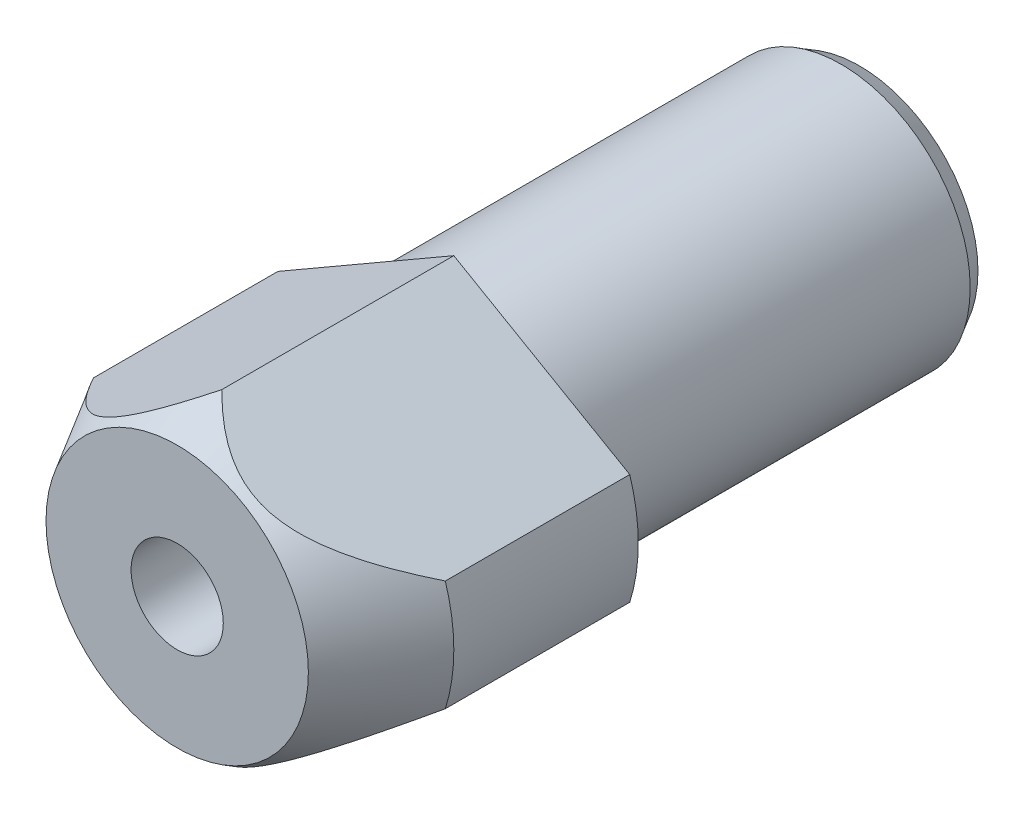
ISO-10303-21;
HEADER;
FILE_DESCRIPTION(('STEP AP214'),'2;1');
FILE_NAME('part.step','',(''),(''),'','','');
FILE_SCHEMA(('AUTOMOTIVE_DESIGN { 1 0 10303 214 1 1 1 1 }'));
ENDSEC;
DATA;
#1=APPLICATION_CONTEXT('core data for automotive mechanical design processes');
#2=APPLICATION_PROTOCOL_DEFINITION('international standard','automotive_design',2000,#1);
#3=PRODUCT_CONTEXT('',#1,'mechanical');
#4=PRODUCT('Part','Part','',(#3));
#5=PRODUCT_RELATED_PRODUCT_CATEGORY('part','',(#4));
#6=PRODUCT_DEFINITION_FORMATION('','',#4);
#7=PRODUCT_DEFINITION_CONTEXT('part definition',#1,'design');
#8=PRODUCT_DEFINITION('design','',#6,#7);
#9=PRODUCT_DEFINITION_SHAPE('','',#8);
#10=(LENGTH_UNIT() NAMED_UNIT(*) SI_UNIT(.MILLI.,.METRE.));
#11=(NAMED_UNIT(*) PLANE_ANGLE_UNIT() SI_UNIT($,.RADIAN.));
#12=(NAMED_UNIT(*) SI_UNIT($,.STERADIAN.) SOLID_ANGLE_UNIT());
#13=UNCERTAINTY_MEASURE_WITH_UNIT(LENGTH_MEASURE(1.E-05),#10,'distance_accuracy_value','');
#14=(GEOMETRIC_REPRESENTATION_CONTEXT(3) GLOBAL_UNCERTAINTY_ASSIGNED_CONTEXT((#13)) GLOBAL_UNIT_ASSIGNED_CONTEXT((#10,
#11,#12)) REPRESENTATION_CONTEXT('',''));
#15=CARTESIAN_POINT('',(0.,0.,0.));
#16=DIRECTION('',(0.,0.,1.));
#17=DIRECTION('',(1.,0.,0.));
#18=AXIS2_PLACEMENT_3D('',#15,#16,#17);
#19=CARTESIAN_POINT('',(7.,0.,0.));
#20=DIRECTION('',(0.,0.,1.));
#21=DIRECTION('',(1.,0.,0.));
#22=AXIS2_PLACEMENT_3D('',#19,#20,#21);
#23=PLANE('',#22);
#24=CARTESIAN_POINT('',(0.,0.,0.));
#25=DIRECTION('',(0.,0.,1.));
#26=DIRECTION('',(1.,0.,0.));
#27=AXIS2_PLACEMENT_3D('',#24,#25,#26);
#28=CIRCLE('',#27,7.);
#29=CARTESIAN_POINT('',(7.,0.,0.));
#30=VERTEX_POINT('',#29);
#31=EDGE_CURVE('E96',#30,#30,#28,.T.);
#32=ORIENTED_EDGE('',*,*,#31,.T.);
#33=EDGE_LOOP('',(#32));
#34=FACE_BOUND('',#33,.T.);
#35=DIRECTION('',(-0.866025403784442,0.5,0.));
#36=VECTOR('',#35,1.);
#37=CARTESIAN_POINT('',(9.53939201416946,3.,0.));
#38=LINE('',#37,#36);
#39=CARTESIAN_POINT('',(9.53939201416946,3.,0.));
#40=VERTEX_POINT('',#39);
#41=CARTESIAN_POINT('',(0.,8.50757054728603,0.));
#42=VERTEX_POINT('',#41);
#43=EDGE_CURVE('E79',#40,#42,#38,.T.);
#44=ORIENTED_EDGE('',*,*,#43,.F.);
#45=CARTESIAN_POINT('',(0.,0.,0.));
#46=DIRECTION('',(0.,0.,1.));
#47=DIRECTION('',(1.,0.,0.));
#48=AXIS2_PLACEMENT_3D('',#45,#46,#47);
#49=CIRCLE('',#48,10.);
#50=CARTESIAN_POINT('',(9.53939201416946,-3.,0.));
#51=VERTEX_POINT('',#50);
#52=EDGE_CURVE('E92',#51,#40,#49,.T.);
#53=ORIENTED_EDGE('',*,*,#52,.F.);
#54=DIRECTION('',(-0.866025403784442,-0.5,0.));
#55=VECTOR('',#54,1.);
#56=CARTESIAN_POINT('',(9.53939201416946,-3.,0.));
#57=LINE('',#56,#55);
#58=CARTESIAN_POINT('',(0.,-8.50757054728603,0.));
#59=VERTEX_POINT('',#58);
#60=EDGE_CURVE('E201',#51,#59,#57,.T.);
#61=ORIENTED_EDGE('',*,*,#60,.T.);
#62=DIRECTION('',(0.866025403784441,-0.5,0.));
#63=VECTOR('',#62,1.);
#64=CARTESIAN_POINT('',(-9.53939201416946,-3.,0.));
#65=LINE('',#64,#63);
#66=CARTESIAN_POINT('',(-9.53939201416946,-3.,0.));
#67=VERTEX_POINT('',#66);
#68=EDGE_CURVE('E91',#67,#59,#65,.T.);
#69=ORIENTED_EDGE('',*,*,#68,.F.);
#70=CARTESIAN_POINT('',(-9.53939201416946,3.,0.));
#71=VERTEX_POINT('',#70);
#72=EDGE_CURVE('E85',#71,#67,#49,.T.);
#73=ORIENTED_EDGE('',*,*,#72,.F.);
#74=DIRECTION('',(0.866025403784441,0.5,0.));
#75=VECTOR('',#74,1.);
#76=CARTESIAN_POINT('',(-9.53939201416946,3.,0.));
#77=LINE('',#76,#75);
#78=EDGE_CURVE('E71',#71,#42,#77,.T.);
#79=ORIENTED_EDGE('',*,*,#78,.T.);
#80=EDGE_LOOP('',(#44,#53,#61,#69,#73,#79));
#81=FACE_BOUND('',#80,.T.);
#82=ADVANCED_FACE('F14',(#34,#81),#23,.F.);
#83=CARTESIAN_POINT('',(0.,0.,30.));
#84=DIRECTION('',(0.,0.,1.));
#85=DIRECTION('',(1.,0.,0.));
#86=AXIS2_PLACEMENT_3D('',#83,#84,#85);
#87=CYLINDRICAL_SURFACE('',#86,10.);
#88=DIRECTION('',(0.,0.,1.));
#89=VECTOR('',#88,1.);
#90=CARTESIAN_POINT('',(9.53939201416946,3.,0.));
#91=LINE('',#90,#89);
#92=CARTESIAN_POINT('',(9.53939201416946,3.,10.));
#93=VERTEX_POINT('',#92);
#94=EDGE_CURVE('E197',#40,#93,#91,.T.);
#95=ORIENTED_EDGE('',*,*,#94,.T.);
#96=CARTESIAN_POINT('',(0.,0.,10.));
#97=DIRECTION('',(0.,0.,1.));
#98=DIRECTION('',(1.,0.,0.));
#99=AXIS2_PLACEMENT_3D('',#96,#97,#98);
#100=CIRCLE('',#99,10.);
#101=CARTESIAN_POINT('',(9.53939201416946,-3.,10.));
#102=VERTEX_POINT('',#101);
#103=EDGE_CURVE('E93',#102,#93,#100,.T.);
#104=ORIENTED_EDGE('',*,*,#103,.F.);
#105=DIRECTION('',(0.,0.,1.));
#106=VECTOR('',#105,1.);
#107=CARTESIAN_POINT('',(9.53939201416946,-3.,0.));
#108=LINE('',#107,#106);
#109=EDGE_CURVE('E209',#51,#102,#108,.T.);
#110=ORIENTED_EDGE('',*,*,#109,.F.);
#111=ORIENTED_EDGE('',*,*,#52,.T.);
#112=EDGE_LOOP('',(#95,#104,#110,#111));
#113=FACE_BOUND('',#112,.T.);
#114=ADVANCED_FACE('F150',(#113),#87,.T.);
#115=CARTESIAN_POINT('',(0.,0.,10.));
#116=DIRECTION('',(0.,0.,-1.));
#117=DIRECTION('',(-1.,0.,0.));
#118=AXIS2_PLACEMENT_3D('',#115,#116,#117);
#119=CONICAL_SURFACE('',#118,10.,0.523598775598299);
#120=CARTESIAN_POINT('',(0.,0.,15.));
#121=DIRECTION('',(0.,0.,1.));
#122=DIRECTION('',(1.,0.,0.));
#123=AXIS2_PLACEMENT_3D('',#120,#121,#122);
#124=CIRCLE('',#123,7.11324865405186);
#125=CARTESIAN_POINT('',(7.11324865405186,0.,15.));
#126=VERTEX_POINT('',#125);
#127=EDGE_CURVE('E191',#126,#126,#124,.T.);
#128=ORIENTED_EDGE('',*,*,#127,.F.);
#129=EDGE_LOOP('',(#128));
#130=FACE_BOUND('',#129,.T.);
#131=CARTESIAN_POINT('',(-0.000200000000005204,8.50768601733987,12.5847636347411));
#132=CARTESIAN_POINT('',(0.0768470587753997,8.46320287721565,12.6618059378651));
#133=CARTESIAN_POINT('',(0.154662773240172,8.41827595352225,12.7378208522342));
#134=CARTESIAN_POINT('',(0.312000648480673,8.32743688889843,12.8875095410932));
#135=CARTESIAN_POINT('',(0.39152328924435,8.28152447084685,12.961182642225));
#136=CARTESIAN_POINT('',(0.633658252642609,8.14172778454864,13.1789310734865));
#137=CARTESIAN_POINT('',(0.799055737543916,8.04623550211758,13.3189441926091));
#138=CARTESIAN_POINT('',(1.14278728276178,7.84778200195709,13.5881294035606));
#139=CARTESIAN_POINT('',(1.32134677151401,7.74469063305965,13.7169212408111));
#140=CARTESIAN_POINT('',(1.68814051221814,7.53292216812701,13.9539744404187));
#141=CARTESIAN_POINT('',(1.87635216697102,7.42425811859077,14.0622812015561));
#142=CARTESIAN_POINT('',(2.17463746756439,7.25204301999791,14.2086042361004));
#143=CARTESIAN_POINT('',(2.28121806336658,7.19050868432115,14.2561557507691));
#144=CARTESIAN_POINT('',(2.49717050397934,7.06582848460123,14.3420410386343));
#145=CARTESIAN_POINT('',(2.60654255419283,7.00268250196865,14.3803741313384));
#146=CARTESIAN_POINT('',(2.82677321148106,6.87553227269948,14.4463573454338));
#147=CARTESIAN_POINT('',(2.93761320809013,6.81153877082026,14.4740895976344));
#148=CARTESIAN_POINT('',(3.16096019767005,6.68258932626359,14.5182955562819));
#149=CARTESIAN_POINT('',(3.2734668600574,6.61763357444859,14.5347714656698));
#150=CARTESIAN_POINT('',(3.50040245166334,6.4866122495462,14.5559083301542));
#151=CARTESIAN_POINT('',(3.61483947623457,6.42054200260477,14.5604548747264));
#152=CARTESIAN_POINT('',(3.84357858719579,6.28847941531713,14.5572057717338));
#153=CARTESIAN_POINT('',(3.95788067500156,6.22248707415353,14.5494102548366));
#154=CARTESIAN_POINT('',(4.18558028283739,6.09102464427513,14.5217881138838));
#155=CARTESIAN_POINT('',(4.29897587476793,6.02555566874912,14.5019405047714));
#156=CARTESIAN_POINT('',(4.52384684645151,5.89572635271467,14.4509948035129));
#157=CARTESIAN_POINT('',(4.63532193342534,5.83136618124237,14.4198950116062));
#158=CARTESIAN_POINT('',(4.88731264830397,5.68587927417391,14.3371748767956));
#159=CARTESIAN_POINT('',(5.02700902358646,5.60522553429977,14.2822289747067));
#160=CARTESIAN_POINT('',(5.30157192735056,5.44670656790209,14.1581314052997));
#161=CARTESIAN_POINT('',(5.43643639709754,5.36884252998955,14.0889737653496));
#162=CARTESIAN_POINT('',(5.70236736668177,5.21530721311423,13.9382955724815));
#163=CARTESIAN_POINT('',(5.83338784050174,5.13966250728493,13.8566677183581));
#164=CARTESIAN_POINT('',(6.09048029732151,4.99123010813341,13.6837792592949));
#165=CARTESIAN_POINT('',(6.21655351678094,4.91844170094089,13.5925210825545));
#166=CARTESIAN_POINT('',(6.49748169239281,4.75624774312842,13.3765760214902));
#167=CARTESIAN_POINT('',(6.65095427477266,4.66764030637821,13.2495011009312));
#168=CARTESIAN_POINT('',(6.95152770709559,4.49410415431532,12.9856136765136));
#169=CARTESIAN_POINT('',(7.09862566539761,4.4091771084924,12.8487968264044));
#170=CARTESIAN_POINT('',(7.38766692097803,4.24229906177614,12.5671934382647));
#171=CARTESIAN_POINT('',(7.52959445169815,4.16035716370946,12.4223854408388));
#172=CARTESIAN_POINT('',(7.80861429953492,3.99926497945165,12.1267672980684));
#173=CARTESIAN_POINT('',(7.94570740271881,3.92011423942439,11.9759581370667));
#174=CARTESIAN_POINT('',(8.20898045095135,3.76811347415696,11.6771857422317));
#175=CARTESIAN_POINT('',(8.335362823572,3.69514657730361,11.529459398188));
#176=CARTESIAN_POINT('',(8.58489189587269,3.55108090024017,11.2303946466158));
#177=CARTESIAN_POINT('',(8.70803835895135,3.47998225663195,11.0790559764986));
#178=CARTESIAN_POINT('',(8.95065631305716,3.33990671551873,10.7744450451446));
#179=CARTESIAN_POINT('',(9.07014739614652,3.27091850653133,10.621193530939));
#180=CARTESIAN_POINT('',(9.30664360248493,3.13437735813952,10.3122153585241));
#181=CARTESIAN_POINT('',(9.42364929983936,3.06682408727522,10.1564892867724));
#182=CARTESIAN_POINT('',(9.53959201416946,2.99988452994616,9.99972954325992));
#183=B_SPLINE_CURVE_WITH_KNOTS('',3,(#131,#132,#133,#134,#135,#136,#137,#138,#139,#140,#141,
#142,#143,#144,#145,#146,#147,#148,#149,#150,#151,#152,#153,#154,#155,#156,#157,#158,#159,#160,
#161,#162,#163,#164,#165,#166,#167,#168,#169,#170,#171,#172,#173,#174,#175,#176,#177,#178,#179,
#180,#181,#182),.UNSPECIFIED.,.F.,.F.,(4,2,2,2,2,2,2,2,2,2,2,2,2,2,2,2,2,2,2,2,2,2,2,2,2,4),(0.,
0.35304866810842,0.70619794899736,1.41609343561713,2.14459244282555,2.87145754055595,
3.26696542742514,3.66250250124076,4.0549098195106,4.44724031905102,4.84332000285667,
5.23939549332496,5.63616261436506,6.03298969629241,6.54338505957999,7.05399536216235,
7.56927639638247,8.08442781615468,8.73817972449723,9.39222514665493,10.0481216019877,
10.7039109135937,11.3267950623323,11.9497246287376,12.5683250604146,13.1867810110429),.UNSPECIFIED.);
#184=CARTESIAN_POINT('',(0.,8.50757054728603,12.5849636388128));
#185=VERTEX_POINT('',#184);
#186=EDGE_CURVE('E9',#185,#93,#183,.T.);
#187=ORIENTED_EDGE('',*,*,#186,.F.);
#188=CARTESIAN_POINT('',(0.000199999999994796,8.50768601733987,12.5847636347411));
#189=CARTESIAN_POINT('',(-0.076847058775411,8.46320287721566,12.6618059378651));
#190=CARTESIAN_POINT('',(-0.154662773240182,8.41827595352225,12.7378208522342));
#191=CARTESIAN_POINT('',(-0.312000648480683,8.32743688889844,12.8875095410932));
#192=CARTESIAN_POINT('',(-0.391523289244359,8.28152447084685,12.961182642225));
#193=CARTESIAN_POINT('',(-0.633658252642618,8.14172778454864,13.1789310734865));
#194=CARTESIAN_POINT('',(-0.799055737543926,8.04623550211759,13.3189441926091));
#195=CARTESIAN_POINT('',(-1.1427872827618,7.8477820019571,13.5881294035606));
#196=CARTESIAN_POINT('',(-1.32134677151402,7.74469063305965,13.7169212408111));
#197=CARTESIAN_POINT('',(-1.68814051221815,7.53292216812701,13.9539744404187));
#198=CARTESIAN_POINT('',(-1.87635216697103,7.42425811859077,14.0622812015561));
#199=CARTESIAN_POINT('',(-2.1746374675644,7.25204301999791,14.2086042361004));
#200=CARTESIAN_POINT('',(-2.28121806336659,7.19050868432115,14.2561557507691));
#201=CARTESIAN_POINT('',(-2.49717050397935,7.06582848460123,14.3420410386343));
#202=CARTESIAN_POINT('',(-2.60654255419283,7.00268250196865,14.3803741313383));
#203=CARTESIAN_POINT('',(-2.82677321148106,6.87553227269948,14.4463573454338));
#204=CARTESIAN_POINT('',(-2.93761320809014,6.81153877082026,14.4740895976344));
#205=CARTESIAN_POINT('',(-3.16096019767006,6.68258932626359,14.5182955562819));
#206=CARTESIAN_POINT('',(-3.27346686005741,6.61763357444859,14.5347714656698));
#207=CARTESIAN_POINT('',(-3.50040245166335,6.4866122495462,14.5559083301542));
#208=CARTESIAN_POINT('',(-3.61483947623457,6.42054200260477,14.5604548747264));
#209=CARTESIAN_POINT('',(-3.84357858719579,6.28847941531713,14.5572057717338));
#210=CARTESIAN_POINT('',(-3.95788067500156,6.22248707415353,14.5494102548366));
#211=CARTESIAN_POINT('',(-4.18558028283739,6.09102464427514,14.5217881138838));
#212=CARTESIAN_POINT('',(-4.29897587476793,6.02555566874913,14.5019405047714));
#213=CARTESIAN_POINT('',(-4.52384684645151,5.89572635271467,14.4509948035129));
#214=CARTESIAN_POINT('',(-4.63532193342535,5.83136618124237,14.4198950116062));
#215=CARTESIAN_POINT('',(-4.88731264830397,5.68587927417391,14.3371748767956));
#216=CARTESIAN_POINT('',(-5.02700902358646,5.60522553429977,14.2822289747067));
#217=CARTESIAN_POINT('',(-5.30157192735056,5.44670656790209,14.1581314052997));
#218=CARTESIAN_POINT('',(-5.43643639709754,5.36884252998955,14.0889737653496));
#219=CARTESIAN_POINT('',(-5.70236736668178,5.21530721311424,13.9382955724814));
#220=CARTESIAN_POINT('',(-5.83338784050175,5.13966250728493,13.8566677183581));
#221=CARTESIAN_POINT('',(-6.09048029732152,4.99123010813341,13.6837792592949));
#222=CARTESIAN_POINT('',(-6.21655351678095,4.91844170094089,13.5925210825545));
#223=CARTESIAN_POINT('',(-6.49748169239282,4.75624774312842,13.3765760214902));
#224=CARTESIAN_POINT('',(-6.65095427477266,4.66764030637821,13.2495011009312));
#225=CARTESIAN_POINT('',(-6.95152770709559,4.49410415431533,12.9856136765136));
#226=CARTESIAN_POINT('',(-7.09862566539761,4.4091771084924,12.8487968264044));
#227=CARTESIAN_POINT('',(-7.38766692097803,4.24229906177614,12.5671934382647));
#228=CARTESIAN_POINT('',(-7.52959445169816,4.16035716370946,12.4223854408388));
#229=CARTESIAN_POINT('',(-7.80861429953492,3.99926497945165,12.1267672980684));
#230=CARTESIAN_POINT('',(-7.94570740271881,3.92011423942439,11.9759581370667));
#231=CARTESIAN_POINT('',(-8.20898045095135,3.76811347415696,11.6771857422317));
#232=CARTESIAN_POINT('',(-8.33536282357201,3.69514657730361,11.529459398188));
#233=CARTESIAN_POINT('',(-8.58489189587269,3.55108090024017,11.2303946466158));
#234=CARTESIAN_POINT('',(-8.70803835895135,3.47998225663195,11.0790559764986));
#235=CARTESIAN_POINT('',(-8.95065631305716,3.33990671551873,10.7744450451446));
#236=CARTESIAN_POINT('',(-9.07014739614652,3.27091850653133,10.621193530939));
#237=CARTESIAN_POINT('',(-9.30664360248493,3.13437735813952,10.3122153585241));
#238=CARTESIAN_POINT('',(-9.42364929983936,3.06682408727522,10.1564892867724));
#239=CARTESIAN_POINT('',(-9.53959201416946,2.99988452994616,9.99972954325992));
#240=B_SPLINE_CURVE_WITH_KNOTS('',3,(#188,#189,#190,#191,#192,#193,#194,#195,#196,#197,#198,
#199,#200,#201,#202,#203,#204,#205,#206,#207,#208,#209,#210,#211,#212,#213,#214,#215,#216,#217,
#218,#219,#220,#221,#222,#223,#224,#225,#226,#227,#228,#229,#230,#231,#232,#233,#234,#235,#236,
#237,#238,#239),.UNSPECIFIED.,.F.,.F.,(4,2,2,2,2,2,2,2,2,2,2,2,2,2,2,2,2,2,2,2,2,2,2,2,2,4),(0.,
0.353048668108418,0.706197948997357,1.41609343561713,2.14459244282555,2.87145754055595,
3.26696542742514,3.66250250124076,4.0549098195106,4.44724031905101,4.84332000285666,
5.23939549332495,5.63616261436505,6.0329896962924,6.54338505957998,7.05399536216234,
7.56927639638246,8.08442781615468,8.73817972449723,9.39222514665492,10.0481216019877,
10.7039109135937,11.3267950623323,11.9497246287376,12.5683250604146,13.1867810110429),.UNSPECIFIED.);
#241=CARTESIAN_POINT('',(-9.53939201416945,3.,10.));
#242=VERTEX_POINT('',#241);
#243=EDGE_CURVE('E28',#185,#242,#240,.T.);
#244=ORIENTED_EDGE('',*,*,#243,.T.);
#245=CARTESIAN_POINT('',(-9.53939201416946,-3.,10.));
#246=VERTEX_POINT('',#245);
#247=EDGE_CURVE('E87',#242,#246,#100,.T.);
#248=ORIENTED_EDGE('',*,*,#247,.T.);
#249=CARTESIAN_POINT('',(0.000199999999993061,-8.50768601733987,12.5847636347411));
#250=CARTESIAN_POINT('',(-0.076847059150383,-8.46320287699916,12.66180593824));
#251=CARTESIAN_POINT('',(-0.154662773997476,-8.41827595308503,12.7378208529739));
#252=CARTESIAN_POINT('',(-0.312000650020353,-8.32743688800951,12.8875095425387));
#253=CARTESIAN_POINT('',(-0.391523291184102,-8.28152446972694,12.9611826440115));
#254=CARTESIAN_POINT('',(-0.633658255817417,-8.14172778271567,13.1789310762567));
#255=CARTESIAN_POINT('',(-0.799055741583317,-8.04623549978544,13.3189441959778));
#256=CARTESIAN_POINT('',(-1.14278728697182,-7.84778199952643,13.5881294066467));
#257=CARTESIAN_POINT('',(-1.32134677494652,-7.74469063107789,13.7169212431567));
#258=CARTESIAN_POINT('',(-1.68814051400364,-7.53292216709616,13.953974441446));
#259=CARTESIAN_POINT('',(-1.87635216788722,-7.42425811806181,14.0622812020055));
#260=CARTESIAN_POINT('',(-2.17463746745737,-7.2520430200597,14.2086042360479));
#261=CARTESIAN_POINT('',(-2.28121806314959,-7.19050868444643,14.2561557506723));
#262=CARTESIAN_POINT('',(-2.49717050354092,-7.06582848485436,14.3420410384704));
#263=CARTESIAN_POINT('',(-2.60654255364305,-7.00268250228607,14.3803741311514));
#264=CARTESIAN_POINT('',(-2.82677321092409,-6.87553227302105,14.4463573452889));
#265=CARTESIAN_POINT('',(-2.93761320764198,-6.811538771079,14.4740895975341));
#266=CARTESIAN_POINT('',(-3.16096019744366,-6.6825893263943,14.5182955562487));
#267=CARTESIAN_POINT('',(-3.27346685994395,-6.61763357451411,14.5347714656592));
#268=CARTESIAN_POINT('',(-3.50040245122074,-6.48661224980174,14.555908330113));
#269=CARTESIAN_POINT('',(-3.6148394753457,-6.42054200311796,14.5604548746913));
#270=CARTESIAN_POINT('',(-3.84357858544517,-6.28847941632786,14.5572057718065));
#271=CARTESIAN_POINT('',(-3.95788067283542,-6.22248707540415,14.5494102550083));
#272=CARTESIAN_POINT('',(-4.18558028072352,-6.09102464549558,14.5217881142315));
#273=CARTESIAN_POINT('',(-4.29897587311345,-6.02555566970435,14.5019405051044));
#274=CARTESIAN_POINT('',(-4.52384684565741,-5.89572635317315,14.4509948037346));
#275=CARTESIAN_POINT('',(-4.63532193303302,-5.83136618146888,14.4198950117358));
#276=CARTESIAN_POINT('',(-4.88731265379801,-5.68587927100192,14.337174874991));
#277=CARTESIAN_POINT('',(-5.02700903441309,-5.60522552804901,14.2822289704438));
#278=CARTESIAN_POINT('',(-5.30157194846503,-5.44670655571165,14.1581313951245));
#279=CARTESIAN_POINT('',(-5.43643642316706,-5.36884251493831,14.0889737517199));
#280=CARTESIAN_POINT('',(-5.70236739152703,-5.21530719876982,13.9382955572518));
#281=CARTESIAN_POINT('',(-5.83338785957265,-5.13966249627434,13.8566677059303));
#282=CARTESIAN_POINT('',(-6.09048030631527,-4.99123010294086,13.6837792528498));
#283=CARTESIAN_POINT('',(-6.21655352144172,-4.91844169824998,13.5925210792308));
#284=CARTESIAN_POINT('',(-6.49747874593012,-4.75624944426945,13.376578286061));
#285=CARTESIAN_POINT('',(-6.65094851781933,-4.66764363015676,13.2495058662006));
#286=CARTESIAN_POINT('',(-6.95151655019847,-4.49411059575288,12.9856237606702));
#287=CARTESIAN_POINT('',(-7.09861191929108,-4.40918504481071,12.8488097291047));
#288=CARTESIAN_POINT('',(-7.38764815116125,-4.24230989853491,12.567212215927));
#289=CARTESIAN_POINT('',(-7.52957324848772,-4.16036940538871,12.4224072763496));
#290=CARTESIAN_POINT('',(-7.80858837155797,-3.99927994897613,12.1267953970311));
#291=CARTESIAN_POINT('',(-7.9456791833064,-3.92013053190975,11.9759894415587));
#292=CARTESIAN_POINT('',(-8.20894803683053,-3.76813218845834,11.6772232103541));
#293=CARTESIAN_POINT('',(-8.33532849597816,-3.69516639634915,11.5294998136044));
#294=CARTESIAN_POINT('',(-8.58485381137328,-3.55110288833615,11.2304410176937));
#295=CARTESIAN_POINT('',(-8.7079984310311,-3.48000530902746,11.0791053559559));
#296=CARTESIAN_POINT('',(-8.95061279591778,-3.33993184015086,10.7745004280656));
#297=CARTESIAN_POINT('',(-9.07010213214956,-3.27094463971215,10.6212519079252));
#298=CARTESIAN_POINT('',(-9.30659488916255,-3.13440548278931,10.3122797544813));
#299=CARTESIAN_POINT('',(-9.42359888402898,-3.06685319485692,10.1565567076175));
#300=CARTESIAN_POINT('',(-9.53953991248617,-2.99991461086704,9.9998));
#301=B_SPLINE_CURVE_WITH_KNOTS('',3,(#249,#250,#251,#252,#253,#254,#255,#256,#257,#258,#259,
#260,#261,#262,#263,#264,#265,#266,#267,#268,#269,#270,#271,#272,#273,#274,#275,#276,#277,#278,
#279,#280,#281,#282,#283,#284,#285,#286,#287,#288,#289,#290,#291,#292,#293,#294,#295,#296,#297,
#298,#299,#300),.UNSPECIFIED.,.F.,.F.,(4,2,2,2,2,2,2,2,2,2,2,2,2,2,2,2,2,2,2,2,2,2,2,2,2,4),(0.,
0.353048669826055,0.706197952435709,1.41609344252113,2.14459244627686,2.87145754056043,
3.2669654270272,3.66250250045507,4.05490981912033,4.44724031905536,4.84332000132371,
5.23939549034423,5.63616261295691,6.03298969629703,6.54338507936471,7.05399540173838,
7.56927641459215,8.08442781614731,8.73816746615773,9.39220061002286,10.0480846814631,
10.7038616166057,11.3267348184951,11.9496534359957,12.5682431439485,13.1866883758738),.UNSPECIFIED.);
#302=CARTESIAN_POINT('',(0.,-8.50757054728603,12.5849636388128));
#303=VERTEX_POINT('',#302);
#304=EDGE_CURVE('E115',#303,#246,#301,.T.);
#305=ORIENTED_EDGE('',*,*,#304,.F.);
#306=CARTESIAN_POINT('',(-0.000200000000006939,-8.50768601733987,12.5847636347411));
#307=CARTESIAN_POINT('',(0.0768470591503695,-8.46320287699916,12.66180593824));
#308=CARTESIAN_POINT('',(0.154662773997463,-8.41827595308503,12.7378208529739));
#309=CARTESIAN_POINT('',(0.31200065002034,-8.32743688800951,12.8875095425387));
#310=CARTESIAN_POINT('',(0.391523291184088,-8.28152446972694,12.9611826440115));
#311=CARTESIAN_POINT('',(0.633658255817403,-8.14172778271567,13.1789310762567));
#312=CARTESIAN_POINT('',(0.799055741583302,-8.04623549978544,13.3189441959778));
#313=CARTESIAN_POINT('',(1.14278728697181,-7.84778199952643,13.5881294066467));
#314=CARTESIAN_POINT('',(1.32134677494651,-7.74469063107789,13.7169212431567));
#315=CARTESIAN_POINT('',(1.68814051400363,-7.53292216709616,13.953974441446));
#316=CARTESIAN_POINT('',(1.8763521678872,-7.42425811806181,14.0622812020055));
#317=CARTESIAN_POINT('',(2.17463746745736,-7.2520430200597,14.2086042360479));
#318=CARTESIAN_POINT('',(2.28121806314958,-7.19050868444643,14.2561557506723));
#319=CARTESIAN_POINT('',(2.49717050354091,-7.06582848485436,14.3420410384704));
#320=CARTESIAN_POINT('',(2.60654255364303,-7.00268250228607,14.3803741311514));
#321=CARTESIAN_POINT('',(2.82677321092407,-6.87553227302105,14.4463573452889));
#322=CARTESIAN_POINT('',(2.93761320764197,-6.81153877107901,14.4740895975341));
#323=CARTESIAN_POINT('',(3.16096019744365,-6.6825893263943,14.5182955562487));
#324=CARTESIAN_POINT('',(3.27346685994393,-6.61763357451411,14.5347714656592));
#325=CARTESIAN_POINT('',(3.50040245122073,-6.48661224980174,14.555908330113));
#326=CARTESIAN_POINT('',(3.61483947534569,-6.42054200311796,14.5604548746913));
#327=CARTESIAN_POINT('',(3.84357858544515,-6.28847941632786,14.5572057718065));
#328=CARTESIAN_POINT('',(3.95788067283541,-6.22248707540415,14.5494102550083));
#329=CARTESIAN_POINT('',(4.18558028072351,-6.09102464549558,14.5217881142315));
#330=CARTESIAN_POINT('',(4.29897587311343,-6.02555566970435,14.5019405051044));
#331=CARTESIAN_POINT('',(4.52384684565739,-5.89572635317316,14.4509948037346));
#332=CARTESIAN_POINT('',(4.635321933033,-5.83136618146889,14.4198950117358));
#333=CARTESIAN_POINT('',(4.88731265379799,-5.68587927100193,14.337174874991));
#334=CARTESIAN_POINT('',(5.02700903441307,-5.60522552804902,14.2822289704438));
#335=CARTESIAN_POINT('',(5.30157194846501,-5.44670655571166,14.1581313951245));
#336=CARTESIAN_POINT('',(5.43643642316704,-5.36884251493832,14.0889737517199));
#337=CARTESIAN_POINT('',(5.70236739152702,-5.21530719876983,13.9382955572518));
#338=CARTESIAN_POINT('',(5.83338785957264,-5.13966249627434,13.8566677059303));
#339=CARTESIAN_POINT('',(6.09048030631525,-4.99123010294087,13.6837792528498));
#340=CARTESIAN_POINT('',(6.2165535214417,-4.91844169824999,13.5925210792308));
#341=CARTESIAN_POINT('',(6.4974787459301,-4.75624944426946,13.376578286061));
#342=CARTESIAN_POINT('',(6.65094851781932,-4.66764363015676,13.2495058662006));
#343=CARTESIAN_POINT('',(6.95151655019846,-4.49411059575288,12.9856237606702));
#344=CARTESIAN_POINT('',(7.09861191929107,-4.40918504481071,12.8488097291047));
#345=CARTESIAN_POINT('',(7.38764815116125,-4.24230989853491,12.5672122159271));
#346=CARTESIAN_POINT('',(7.52957324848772,-4.16036940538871,12.4224072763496));
#347=CARTESIAN_POINT('',(7.80858837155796,-3.99927994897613,12.1267953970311));
#348=CARTESIAN_POINT('',(7.9456791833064,-3.92013053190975,11.9759894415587));
#349=CARTESIAN_POINT('',(8.20894803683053,-3.76813218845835,11.6772232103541));
#350=CARTESIAN_POINT('',(8.33532849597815,-3.69516639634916,11.5294998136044));
#351=CARTESIAN_POINT('',(8.58485381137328,-3.55110288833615,11.2304410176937));
#352=CARTESIAN_POINT('',(8.70799843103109,-3.48000530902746,11.0791053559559));
#353=CARTESIAN_POINT('',(8.95061279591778,-3.33993184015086,10.7745004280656));
#354=CARTESIAN_POINT('',(9.07010213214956,-3.27094463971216,10.6212519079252));
#355=CARTESIAN_POINT('',(9.30659488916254,-3.13440548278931,10.3122797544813));
#356=CARTESIAN_POINT('',(9.42359888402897,-3.06685319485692,10.1565567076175));
#357=CARTESIAN_POINT('',(9.53953991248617,-2.99991461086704,9.9998));
#358=B_SPLINE_CURVE_WITH_KNOTS('',3,(#306,#307,#308,#309,#310,#311,#312,#313,#314,#315,#316,
#317,#318,#319,#320,#321,#322,#323,#324,#325,#326,#327,#328,#329,#330,#331,#332,#333,#334,#335,
#336,#337,#338,#339,#340,#341,#342,#343,#344,#345,#346,#347,#348,#349,#350,#351,#352,#353,#354,
#355,#356,#357),.UNSPECIFIED.,.F.,.F.,(4,2,2,2,2,2,2,2,2,2,2,2,2,2,2,2,2,2,2,2,2,2,2,2,2,4),(0.,
0.353048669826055,0.706197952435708,1.41609344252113,2.14459244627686,2.87145754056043,
3.2669654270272,3.66250250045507,4.05490981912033,4.44724031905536,4.84332000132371,
5.23939549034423,5.63616261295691,6.03298969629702,6.5433850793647,7.05399540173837,
7.56927641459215,8.08442781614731,8.73816746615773,9.39220061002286,10.0480846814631,
10.7038616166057,11.3267348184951,11.9496534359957,12.5682431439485,13.1866883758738),.UNSPECIFIED.);
#359=EDGE_CURVE('E122',#303,#102,#358,.T.);
#360=ORIENTED_EDGE('',*,*,#359,.T.);
#361=ORIENTED_EDGE('',*,*,#103,.T.);
#362=EDGE_LOOP('',(#187,#244,#248,#305,#360,#361));
#363=FACE_BOUND('',#362,.T.);
#364=ADVANCED_FACE('F128',(#130,#363),#119,.T.);
#365=CARTESIAN_POINT('',(0.,0.,-18.));
#366=DIRECTION('',(0.,0.,1.));
#367=DIRECTION('',(1.,0.,0.));
#368=AXIS2_PLACEMENT_3D('',#365,#366,#367);
#369=PLANE('',#368);
#370=CARTESIAN_POINT('',(0.,0.,-18.));
#371=DIRECTION('',(0.,0.,1.));
#372=DIRECTION('',(1.,0.,0.));
#373=AXIS2_PLACEMENT_3D('',#370,#371,#372);
#374=CIRCLE('',#373,1.);
#375=CARTESIAN_POINT('',(1.,0.,-18.));
#376=VERTEX_POINT('',#375);
#377=EDGE_CURVE('E112',#376,#376,#374,.T.);
#378=ORIENTED_EDGE('',*,*,#377,.F.);
#379=EDGE_LOOP('',(#378));
#380=FACE_BOUND('',#379,.T.);
#381=ADVANCED_FACE('F16',(#380),#369,.F.);
#382=CARTESIAN_POINT('',(0.,0.,30.));
#383=DIRECTION('',(0.,0.,1.));
#384=DIRECTION('',(1.,0.,0.));
#385=AXIS2_PLACEMENT_3D('',#382,#383,#384);
#386=CYLINDRICAL_SURFACE('',#385,1.);
#387=CARTESIAN_POINT('',(0.,0.,-22.));
#388=DIRECTION('',(0.,0.,1.));
#389=DIRECTION('',(1.,0.,0.));
#390=AXIS2_PLACEMENT_3D('',#387,#388,#389);
#391=CIRCLE('',#390,1.);
#392=CARTESIAN_POINT('',(1.,0.,-22.));
#393=VERTEX_POINT('',#392);
#394=EDGE_CURVE('E109',#393,#393,#391,.T.);
#395=ORIENTED_EDGE('',*,*,#394,.F.);
#396=EDGE_LOOP('',(#395));
#397=FACE_BOUND('',#396,.T.);
#398=ORIENTED_EDGE('',*,*,#377,.T.);
#399=EDGE_LOOP('',(#398));
#400=FACE_BOUND('',#399,.T.);
#401=ADVANCED_FACE('F170',(#397,#400),#386,.F.);
#402=CARTESIAN_POINT('',(1.,0.,-22.));
#403=DIRECTION('',(0.,0.,1.));
#404=DIRECTION('',(1.,0.,0.));
#405=AXIS2_PLACEMENT_3D('',#402,#403,#404);
#406=PLANE('',#405);
#407=CARTESIAN_POINT('',(0.,0.,-22.));
#408=DIRECTION('',(0.,0.,1.));
#409=DIRECTION('',(1.,0.,0.));
#410=AXIS2_PLACEMENT_3D('',#407,#408,#409);
#411=CIRCLE('',#410,6.42264973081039);
#412=CARTESIAN_POINT('',(6.42264973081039,0.,-22.));
#413=VERTEX_POINT('',#412);
#414=EDGE_CURVE('E106',#413,#413,#411,.T.);
#415=ORIENTED_EDGE('',*,*,#414,.F.);
#416=EDGE_LOOP('',(#415));
#417=FACE_BOUND('',#416,.T.);
#418=ORIENTED_EDGE('',*,*,#394,.T.);
#419=EDGE_LOOP('',(#418));
#420=FACE_BOUND('',#419,.T.);
#421=ADVANCED_FACE('F167',(#417,#420),#406,.F.);
#422=CARTESIAN_POINT('',(0.,0.,-21.));
#423=DIRECTION('',(0.,0.,1.));
#424=DIRECTION('',(1.,0.,0.));
#425=AXIS2_PLACEMENT_3D('',#422,#423,#424);
#426=CONICAL_SURFACE('',#425,7.,0.523598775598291);
#427=ORIENTED_EDGE('',*,*,#414,.T.);
#428=EDGE_LOOP('',(#427));
#429=FACE_BOUND('',#428,.T.);
#430=CARTESIAN_POINT('',(0.,0.,-21.));
#431=DIRECTION('',(0.,0.,1.));
#432=DIRECTION('',(1.,0.,0.));
#433=AXIS2_PLACEMENT_3D('',#430,#431,#432);
#434=CIRCLE('',#433,7.);
#435=CARTESIAN_POINT('',(7.,0.,-21.));
#436=VERTEX_POINT('',#435);
#437=EDGE_CURVE('E103',#436,#436,#434,.T.);
#438=ORIENTED_EDGE('',*,*,#437,.F.);
#439=EDGE_LOOP('',(#438));
#440=FACE_BOUND('',#439,.T.);
#441=ADVANCED_FACE('F163',(#429,#440),#426,.T.);
#442=CARTESIAN_POINT('',(0.,0.,30.));
#443=DIRECTION('',(0.,0.,1.));
#444=DIRECTION('',(1.,0.,0.));
#445=AXIS2_PLACEMENT_3D('',#442,#443,#444);
#446=CYLINDRICAL_SURFACE('',#445,7.);
#447=ORIENTED_EDGE('',*,*,#31,.F.);
#448=EDGE_LOOP('',(#447));
#449=FACE_BOUND('',#448,.T.);
#450=ORIENTED_EDGE('',*,*,#437,.T.);
#451=EDGE_LOOP('',(#450));
#452=FACE_BOUND('',#451,.T.);
#453=ADVANCED_FACE('F149',(#449,#452),#446,.T.);
#454=ORIENTED_EDGE('',*,*,#247,.F.);
#455=DIRECTION('',(0.,0.,1.));
#456=VECTOR('',#455,1.);
#457=CARTESIAN_POINT('',(-9.53939201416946,3.,0.));
#458=LINE('',#457,#456);
#459=EDGE_CURVE('E35',#71,#242,#458,.T.);
#460=ORIENTED_EDGE('',*,*,#459,.F.);
#461=ORIENTED_EDGE('',*,*,#72,.T.);
#462=DIRECTION('',(0.,0.,1.));
#463=VECTOR('',#462,1.);
#464=CARTESIAN_POINT('',(-9.53939201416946,-3.,0.));
#465=LINE('',#464,#463);
#466=EDGE_CURVE('E207',#67,#246,#465,.T.);
#467=ORIENTED_EDGE('',*,*,#466,.T.);
#468=EDGE_LOOP('',(#454,#460,#461,#467));
#469=FACE_BOUND('',#468,.T.);
#470=ADVANCED_FACE('F83',(#469),#87,.T.);
#471=CARTESIAN_POINT('',(7.11324865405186,0.,15.));
#472=DIRECTION('',(0.,0.,-1.));
#473=DIRECTION('',(-1.,0.,0.));
#474=AXIS2_PLACEMENT_3D('',#471,#472,#473);
#475=PLANE('',#474);
#476=CARTESIAN_POINT('',(0.,0.,15.));
#477=DIRECTION('',(0.,0.,1.));
#478=DIRECTION('',(1.,0.,0.));
#479=AXIS2_PLACEMENT_3D('',#476,#477,#478);
#480=CIRCLE('',#479,2.5);
#481=CARTESIAN_POINT('',(2.5,0.,15.));
#482=VERTEX_POINT('',#481);
#483=EDGE_CURVE('E211',#482,#482,#480,.T.);
#484=ORIENTED_EDGE('',*,*,#483,.F.);
#485=EDGE_LOOP('',(#484));
#486=FACE_BOUND('',#485,.T.);
#487=ORIENTED_EDGE('',*,*,#127,.T.);
#488=EDGE_LOOP('',(#487));
#489=FACE_BOUND('',#488,.T.);
#490=ADVANCED_FACE('F141',(#486,#489),#475,.F.);
#491=CARTESIAN_POINT('',(0.,0.,30.));
#492=DIRECTION('',(0.,0.,1.));
#493=DIRECTION('',(1.,0.,0.));
#494=AXIS2_PLACEMENT_3D('',#491,#492,#493);
#495=CYLINDRICAL_SURFACE('',#494,2.5);
#496=CARTESIAN_POINT('',(0.,0.,7.));
#497=DIRECTION('',(0.,0.,1.));
#498=DIRECTION('',(1.,0.,0.));
#499=AXIS2_PLACEMENT_3D('',#496,#497,#498);
#500=CIRCLE('',#499,2.5);
#501=CARTESIAN_POINT('',(2.5,0.,7.));
#502=VERTEX_POINT('',#501);
#503=EDGE_CURVE('E324',#502,#502,#500,.T.);
#504=ORIENTED_EDGE('',*,*,#503,.F.);
#505=EDGE_LOOP('',(#504));
#506=FACE_BOUND('',#505,.T.);
#507=ORIENTED_EDGE('',*,*,#483,.T.);
#508=EDGE_LOOP('',(#507));
#509=FACE_BOUND('',#508,.T.);
#510=ADVANCED_FACE('F139',(#506,#509),#495,.F.);
#511=CARTESIAN_POINT('',(9.53939201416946,-3.,0.));
#512=DIRECTION('',(-0.5,0.866025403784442,0.));
#513=DIRECTION('',(-0.866025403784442,-0.5,0.));
#514=AXIS2_PLACEMENT_3D('',#511,#512,#513);
#515=PLANE('',#514);
#516=DIRECTION('',(0.,0.,1.));
#517=VECTOR('',#516,1.);
#518=CARTESIAN_POINT('',(0.,-8.50757054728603,0.));
#519=LINE('',#518,#517);
#520=EDGE_CURVE('E43',#59,#303,#519,.T.);
#521=ORIENTED_EDGE('',*,*,#520,.F.);
#522=ORIENTED_EDGE('',*,*,#60,.F.);
#523=ORIENTED_EDGE('',*,*,#109,.T.);
#524=ORIENTED_EDGE('',*,*,#359,.F.);
#525=EDGE_LOOP('',(#521,#522,#523,#524));
#526=FACE_BOUND('',#525,.T.);
#527=ADVANCED_FACE('F137',(#526),#515,.F.);
#528=CARTESIAN_POINT('',(-9.53939201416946,-3.,0.));
#529=DIRECTION('',(-0.5,-0.866025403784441,0.));
#530=DIRECTION('',(0.866025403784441,-0.5,0.));
#531=AXIS2_PLACEMENT_3D('',#528,#529,#530);
#532=PLANE('',#531);
#533=ORIENTED_EDGE('',*,*,#304,.T.);
#534=ORIENTED_EDGE('',*,*,#466,.F.);
#535=ORIENTED_EDGE('',*,*,#68,.T.);
#536=ORIENTED_EDGE('',*,*,#520,.T.);
#537=EDGE_LOOP('',(#533,#534,#535,#536));
#538=FACE_BOUND('',#537,.T.);
#539=ADVANCED_FACE('F132',(#538),#532,.T.);
#540=CARTESIAN_POINT('',(9.53939201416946,3.,0.));
#541=DIRECTION('',(0.5,0.866025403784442,0.));
#542=DIRECTION('',(-0.866025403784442,0.5,0.));
#543=AXIS2_PLACEMENT_3D('',#540,#541,#542);
#544=PLANE('',#543);
#545=ORIENTED_EDGE('',*,*,#186,.T.);
#546=ORIENTED_EDGE('',*,*,#94,.F.);
#547=ORIENTED_EDGE('',*,*,#43,.T.);
#548=DIRECTION('',(0.,0.,1.));
#549=VECTOR('',#548,1.);
#550=CARTESIAN_POINT('',(0.,8.50757054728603,0.));
#551=LINE('',#550,#549);
#552=EDGE_CURVE('E74',#42,#185,#551,.T.);
#553=ORIENTED_EDGE('',*,*,#552,.T.);
#554=EDGE_LOOP('',(#545,#546,#547,#553));
#555=FACE_BOUND('',#554,.T.);
#556=ADVANCED_FACE('F136',(#555),#544,.T.);
#557=CARTESIAN_POINT('',(-9.53939201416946,3.,0.));
#558=DIRECTION('',(0.5,-0.866025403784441,0.));
#559=DIRECTION('',(0.866025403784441,0.5,0.));
#560=AXIS2_PLACEMENT_3D('',#557,#558,#559);
#561=PLANE('',#560);
#562=ORIENTED_EDGE('',*,*,#552,.F.);
#563=ORIENTED_EDGE('',*,*,#78,.F.);
#564=ORIENTED_EDGE('',*,*,#459,.T.);
#565=ORIENTED_EDGE('',*,*,#243,.F.);
#566=EDGE_LOOP('',(#562,#563,#564,#565));
#567=FACE_BOUND('',#566,.T.);
#568=ADVANCED_FACE('F72',(#567),#561,.F.);
#569=CARTESIAN_POINT('',(0.,0.,7.));
#570=DIRECTION('',(0.,0.,1.));
#571=DIRECTION('',(1.,0.,0.));
#572=AXIS2_PLACEMENT_3D('',#569,#570,#571);
#573=PLANE('',#572);
#574=ORIENTED_EDGE('',*,*,#503,.T.);
#575=EDGE_LOOP('',(#574));
#576=FACE_BOUND('',#575,.T.);
#577=ADVANCED_FACE('F223',(#576),#573,.T.);
#578=CLOSED_SHELL('',(#82,#114,#364,#381,#401,#421,#441,#453,#470,#490,#510,#527,#539,#556,#568,#577));
#579=MANIFOLD_SOLID_BREP('B1',#578);
#580=ADVANCED_BREP_SHAPE_REPRESENTATION('',(#18,#579),#14);
#581=SHAPE_DEFINITION_REPRESENTATION(#9,#580);
ENDSEC;
END-ISO-10303-21;
